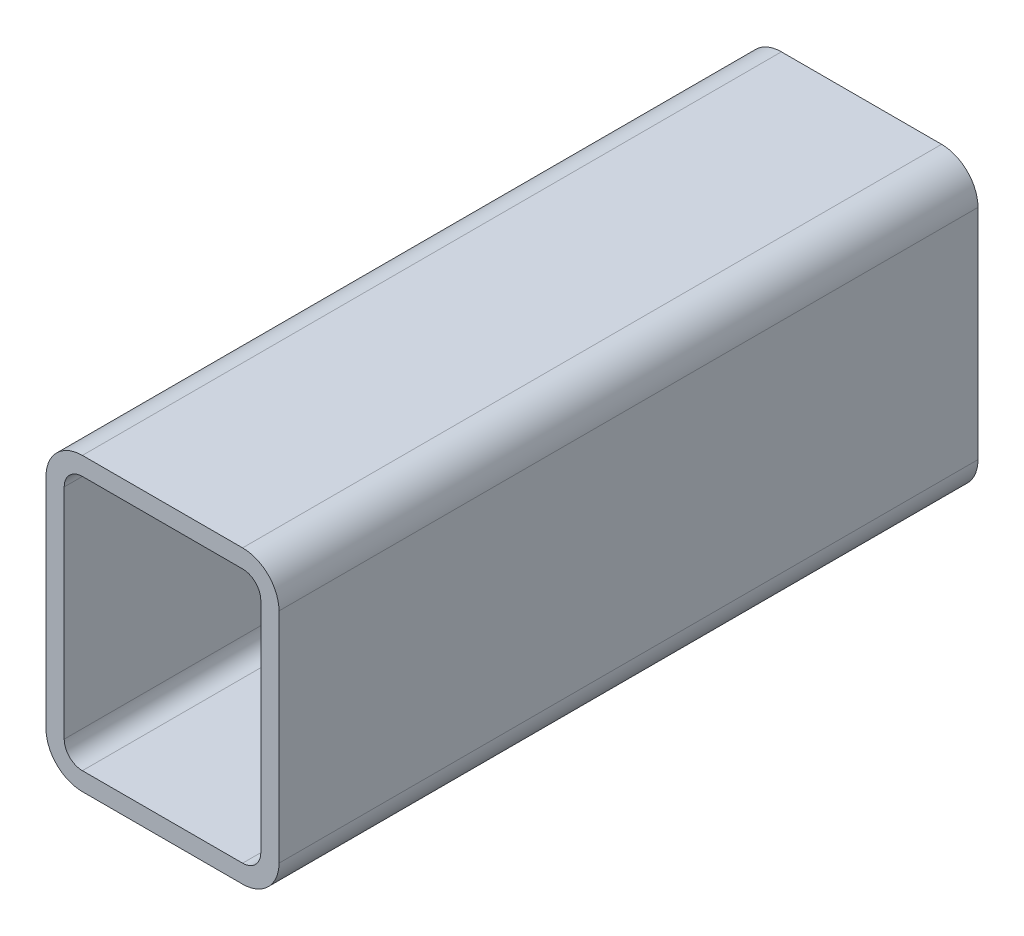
ISO-10303-21;
HEADER;
FILE_DESCRIPTION(('STEP AP214'),'2;1');
FILE_NAME('part.step','',(''),(''),'','','');
FILE_SCHEMA(('AUTOMOTIVE_DESIGN { 1 0 10303 214 1 1 1 1 }'));
ENDSEC;
DATA;
#1=APPLICATION_CONTEXT('core data for automotive mechanical design processes');
#2=APPLICATION_PROTOCOL_DEFINITION('international standard','automotive_design',2000,#1);
#3=PRODUCT_CONTEXT('',#1,'mechanical');
#4=PRODUCT('Part','Part','',(#3));
#5=PRODUCT_RELATED_PRODUCT_CATEGORY('part','',(#4));
#6=PRODUCT_DEFINITION_FORMATION('','',#4);
#7=PRODUCT_DEFINITION_CONTEXT('part definition',#1,'design');
#8=PRODUCT_DEFINITION('design','',#6,#7);
#9=PRODUCT_DEFINITION_SHAPE('','',#8);
#10=(LENGTH_UNIT() NAMED_UNIT(*) SI_UNIT(.MILLI.,.METRE.));
#11=(NAMED_UNIT(*) PLANE_ANGLE_UNIT() SI_UNIT($,.RADIAN.));
#12=(NAMED_UNIT(*) SI_UNIT($,.STERADIAN.) SOLID_ANGLE_UNIT());
#13=UNCERTAINTY_MEASURE_WITH_UNIT(LENGTH_MEASURE(1.E-05),#10,'distance_accuracy_value','');
#14=(GEOMETRIC_REPRESENTATION_CONTEXT(3) GLOBAL_UNCERTAINTY_ASSIGNED_CONTEXT((#13)) GLOBAL_UNIT_ASSIGNED_CONTEXT((#10,
#11,#12)) REPRESENTATION_CONTEXT('',''));
#15=CARTESIAN_POINT('',(0.,0.,0.));
#16=DIRECTION('',(0.,0.,1.));
#17=DIRECTION('',(1.,0.,0.));
#18=AXIS2_PLACEMENT_3D('',#15,#16,#17);
#19=CARTESIAN_POINT('',(17.5501778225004,113.15985662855,304.8));
#20=DIRECTION('',(0.,0.,1.));
#21=DIRECTION('',(1.,0.,0.));
#22=AXIS2_PLACEMENT_3D('',#19,#20,#21);
#23=PLANE('',#22);
#24=CARTESIAN_POINT('',(17.5501778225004,113.15985662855,304.8));
#25=DIRECTION('',(0.,0.,1.));
#26=DIRECTION('',(1.,0.,0.));
#27=AXIS2_PLACEMENT_3D('',#24,#25,#26);
#28=CIRCLE('',#27,15.875);
#29=CARTESIAN_POINT('',(17.5501778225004,129.03485662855,304.8));
#30=VERTEX_POINT('',#29);
#31=CARTESIAN_POINT('',(1.67517782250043,113.15985662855,304.8));
#32=VERTEX_POINT('',#31);
#33=EDGE_CURVE('E211',#30,#32,#28,.T.);
#34=ORIENTED_EDGE('',*,*,#33,.T.);
#35=DIRECTION('',(0.,-1.,0.));
#36=VECTOR('',#35,1.);
#37=CARTESIAN_POINT('',(1.67517782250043,17.90985662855,304.8));
#38=LINE('',#37,#36);
#39=CARTESIAN_POINT('',(1.67517782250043,17.90985662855,304.8));
#40=VERTEX_POINT('',#39);
#41=EDGE_CURVE('E214',#32,#40,#38,.T.);
#42=ORIENTED_EDGE('',*,*,#41,.T.);
#43=CARTESIAN_POINT('',(17.5501778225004,17.90985662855,304.8));
#44=DIRECTION('',(0.,0.,1.));
#45=DIRECTION('',(1.,0.,0.));
#46=AXIS2_PLACEMENT_3D('',#43,#44,#45);
#47=CIRCLE('',#46,15.875);
#48=CARTESIAN_POINT('',(17.5501778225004,2.03485662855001,304.8));
#49=VERTEX_POINT('',#48);
#50=EDGE_CURVE('E217',#40,#49,#47,.T.);
#51=ORIENTED_EDGE('',*,*,#50,.T.);
#52=DIRECTION('',(1.,0.,0.));
#53=VECTOR('',#52,1.);
#54=CARTESIAN_POINT('',(87.4001778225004,2.03485662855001,304.8));
#55=LINE('',#54,#53);
#56=CARTESIAN_POINT('',(87.4001778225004,2.03485662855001,304.8));
#57=VERTEX_POINT('',#56);
#58=EDGE_CURVE('E219',#49,#57,#55,.T.);
#59=ORIENTED_EDGE('',*,*,#58,.T.);
#60=CARTESIAN_POINT('',(87.4001778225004,17.90985662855,304.8));
#61=DIRECTION('',(0.,0.,1.));
#62=DIRECTION('',(1.,0.,0.));
#63=AXIS2_PLACEMENT_3D('',#60,#61,#62);
#64=CIRCLE('',#63,15.875);
#65=CARTESIAN_POINT('',(103.2751778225,17.90985662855,304.8));
#66=VERTEX_POINT('',#65);
#67=EDGE_CURVE('E221',#57,#66,#64,.T.);
#68=ORIENTED_EDGE('',*,*,#67,.T.);
#69=DIRECTION('',(0.,1.,0.));
#70=VECTOR('',#69,1.);
#71=CARTESIAN_POINT('',(103.2751778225,113.15985662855,304.8));
#72=LINE('',#71,#70);
#73=CARTESIAN_POINT('',(103.2751778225,113.15985662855,304.8));
#74=VERTEX_POINT('',#73);
#75=EDGE_CURVE('E223',#66,#74,#72,.T.);
#76=ORIENTED_EDGE('',*,*,#75,.T.);
#77=CARTESIAN_POINT('',(87.4001778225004,113.15985662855,304.8));
#78=DIRECTION('',(0.,0.,1.));
#79=DIRECTION('',(1.,0.,0.));
#80=AXIS2_PLACEMENT_3D('',#77,#78,#79);
#81=CIRCLE('',#80,15.875);
#82=CARTESIAN_POINT('',(87.4001778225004,129.03485662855,304.8));
#83=VERTEX_POINT('',#82);
#84=EDGE_CURVE('E225',#74,#83,#81,.T.);
#85=ORIENTED_EDGE('',*,*,#84,.T.);
#86=DIRECTION('',(-1.,0.,0.));
#87=VECTOR('',#86,1.);
#88=CARTESIAN_POINT('',(17.5501778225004,129.03485662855,304.8));
#89=LINE('',#88,#87);
#90=EDGE_CURVE('E227',#83,#30,#89,.T.);
#91=ORIENTED_EDGE('',*,*,#90,.T.);
#92=EDGE_LOOP('',(#34,#42,#51,#59,#68,#76,#85,#91));
#93=FACE_BOUND('',#92,.T.);
#94=DIRECTION('',(0.,-1.,0.));
#95=VECTOR('',#94,1.);
#96=CARTESIAN_POINT('',(9.61267782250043,17.90985662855,304.8));
#97=LINE('',#96,#95);
#98=CARTESIAN_POINT('',(9.61267782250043,113.15985662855,304.8));
#99=VERTEX_POINT('',#98);
#100=CARTESIAN_POINT('',(9.61267782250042,17.90985662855,304.8));
#101=VERTEX_POINT('',#100);
#102=EDGE_CURVE('E154',#99,#101,#97,.T.);
#103=ORIENTED_EDGE('',*,*,#102,.F.);
#104=CARTESIAN_POINT('',(17.5501778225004,113.15985662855,304.8));
#105=DIRECTION('',(0.,0.,1.));
#106=DIRECTION('',(1.,0.,0.));
#107=AXIS2_PLACEMENT_3D('',#104,#105,#106);
#108=CIRCLE('',#107,7.9375);
#109=CARTESIAN_POINT('',(17.5501778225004,121.09735662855,304.8));
#110=VERTEX_POINT('',#109);
#111=EDGE_CURVE('E146',#110,#99,#108,.T.);
#112=ORIENTED_EDGE('',*,*,#111,.F.);
#113=DIRECTION('',(-1.,0.,0.));
#114=VECTOR('',#113,1.);
#115=CARTESIAN_POINT('',(17.5501778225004,121.09735662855,304.8));
#116=LINE('',#115,#114);
#117=CARTESIAN_POINT('',(87.4001778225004,121.09735662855,304.8));
#118=VERTEX_POINT('',#117);
#119=EDGE_CURVE('E179',#118,#110,#116,.T.);
#120=ORIENTED_EDGE('',*,*,#119,.F.);
#121=CARTESIAN_POINT('',(87.4001778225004,113.15985662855,304.8));
#122=DIRECTION('',(0.,0.,1.));
#123=DIRECTION('',(1.,0.,0.));
#124=AXIS2_PLACEMENT_3D('',#121,#122,#123);
#125=CIRCLE('',#124,7.9375);
#126=CARTESIAN_POINT('',(95.3376778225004,113.15985662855,304.8));
#127=VERTEX_POINT('',#126);
#128=EDGE_CURVE('E177',#127,#118,#125,.T.);
#129=ORIENTED_EDGE('',*,*,#128,.F.);
#130=DIRECTION('',(0.,1.,0.));
#131=VECTOR('',#130,1.);
#132=CARTESIAN_POINT('',(95.3376778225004,113.15985662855,304.8));
#133=LINE('',#132,#131);
#134=CARTESIAN_POINT('',(95.3376778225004,17.90985662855,304.8));
#135=VERTEX_POINT('',#134);
#136=EDGE_CURVE('E175',#135,#127,#133,.T.);
#137=ORIENTED_EDGE('',*,*,#136,.F.);
#138=CARTESIAN_POINT('',(87.4001778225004,17.90985662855,304.8));
#139=DIRECTION('',(0.,0.,1.));
#140=DIRECTION('',(1.,0.,0.));
#141=AXIS2_PLACEMENT_3D('',#138,#139,#140);
#142=CIRCLE('',#141,7.9375);
#143=CARTESIAN_POINT('',(87.4001778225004,9.97235662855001,304.8));
#144=VERTEX_POINT('',#143);
#145=EDGE_CURVE('E173',#144,#135,#142,.T.);
#146=ORIENTED_EDGE('',*,*,#145,.F.);
#147=DIRECTION('',(1.,0.,0.));
#148=VECTOR('',#147,1.);
#149=CARTESIAN_POINT('',(87.4001778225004,9.97235662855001,304.8));
#150=LINE('',#149,#148);
#151=CARTESIAN_POINT('',(17.5501778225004,9.97235662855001,304.8));
#152=VERTEX_POINT('',#151);
#153=EDGE_CURVE('E169',#152,#144,#150,.T.);
#154=ORIENTED_EDGE('',*,*,#153,.F.);
#155=CARTESIAN_POINT('',(17.5501778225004,17.90985662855,304.8));
#156=DIRECTION('',(0.,0.,1.));
#157=DIRECTION('',(1.,0.,0.));
#158=AXIS2_PLACEMENT_3D('',#155,#156,#157);
#159=CIRCLE('',#158,7.9375);
#160=EDGE_CURVE('E167',#101,#152,#159,.T.);
#161=ORIENTED_EDGE('',*,*,#160,.F.);
#162=EDGE_LOOP('',(#103,#112,#120,#129,#137,#146,#154,#161));
#163=FACE_BOUND('',#162,.T.);
#164=ADVANCED_FACE('F33',(#93,#163),#23,.T.);
#165=CARTESIAN_POINT('',(17.5501778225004,113.15985662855,0.));
#166=DIRECTION('',(0.,0.,1.));
#167=DIRECTION('',(1.,0.,0.));
#168=AXIS2_PLACEMENT_3D('',#165,#166,#167);
#169=PLANE('',#168);
#170=CARTESIAN_POINT('',(17.5501778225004,113.15985662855,0.));
#171=DIRECTION('',(0.,0.,1.));
#172=DIRECTION('',(1.,0.,0.));
#173=AXIS2_PLACEMENT_3D('',#170,#171,#172);
#174=CIRCLE('',#173,15.875);
#175=CARTESIAN_POINT('',(17.5501778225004,129.03485662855,0.));
#176=VERTEX_POINT('',#175);
#177=CARTESIAN_POINT('',(1.67517782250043,113.15985662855,0.));
#178=VERTEX_POINT('',#177);
#179=EDGE_CURVE('E162',#176,#178,#174,.T.);
#180=ORIENTED_EDGE('',*,*,#179,.F.);
#181=DIRECTION('',(-1.,0.,0.));
#182=VECTOR('',#181,1.);
#183=CARTESIAN_POINT('',(17.5501778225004,129.03485662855,0.));
#184=LINE('',#183,#182);
#185=CARTESIAN_POINT('',(87.4001778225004,129.03485662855,0.));
#186=VERTEX_POINT('',#185);
#187=EDGE_CURVE('E215',#186,#176,#184,.T.);
#188=ORIENTED_EDGE('',*,*,#187,.F.);
#189=CARTESIAN_POINT('',(87.4001778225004,113.15985662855,0.));
#190=DIRECTION('',(0.,0.,1.));
#191=DIRECTION('',(1.,0.,0.));
#192=AXIS2_PLACEMENT_3D('',#189,#190,#191);
#193=CIRCLE('',#192,15.875);
#194=CARTESIAN_POINT('',(103.2751778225,113.15985662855,0.));
#195=VERTEX_POINT('',#194);
#196=EDGE_CURVE('E242',#195,#186,#193,.T.);
#197=ORIENTED_EDGE('',*,*,#196,.F.);
#198=DIRECTION('',(0.,1.,0.));
#199=VECTOR('',#198,1.);
#200=CARTESIAN_POINT('',(103.2751778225,113.15985662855,0.));
#201=LINE('',#200,#199);
#202=CARTESIAN_POINT('',(103.2751778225,17.90985662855,0.));
#203=VERTEX_POINT('',#202);
#204=EDGE_CURVE('E240',#203,#195,#201,.T.);
#205=ORIENTED_EDGE('',*,*,#204,.F.);
#206=CARTESIAN_POINT('',(87.4001778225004,17.90985662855,0.));
#207=DIRECTION('',(0.,0.,1.));
#208=DIRECTION('',(1.,0.,0.));
#209=AXIS2_PLACEMENT_3D('',#206,#207,#208);
#210=CIRCLE('',#209,15.875);
#211=CARTESIAN_POINT('',(87.4001778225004,2.03485662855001,0.));
#212=VERTEX_POINT('',#211);
#213=EDGE_CURVE('E238',#212,#203,#210,.T.);
#214=ORIENTED_EDGE('',*,*,#213,.F.);
#215=DIRECTION('',(1.,0.,0.));
#216=VECTOR('',#215,1.);
#217=CARTESIAN_POINT('',(87.4001778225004,2.03485662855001,0.));
#218=LINE('',#217,#216);
#219=CARTESIAN_POINT('',(17.5501778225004,2.03485662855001,0.));
#220=VERTEX_POINT('',#219);
#221=EDGE_CURVE('E236',#220,#212,#218,.T.);
#222=ORIENTED_EDGE('',*,*,#221,.F.);
#223=CARTESIAN_POINT('',(17.5501778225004,17.90985662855,0.));
#224=DIRECTION('',(0.,0.,1.));
#225=DIRECTION('',(1.,0.,0.));
#226=AXIS2_PLACEMENT_3D('',#223,#224,#225);
#227=CIRCLE('',#226,15.875);
#228=CARTESIAN_POINT('',(1.67517782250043,17.90985662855,0.));
#229=VERTEX_POINT('',#228);
#230=EDGE_CURVE('E234',#229,#220,#227,.T.);
#231=ORIENTED_EDGE('',*,*,#230,.F.);
#232=DIRECTION('',(0.,-1.,0.));
#233=VECTOR('',#232,1.);
#234=CARTESIAN_POINT('',(1.67517782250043,17.90985662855,0.));
#235=LINE('',#234,#233);
#236=EDGE_CURVE('E232',#178,#229,#235,.T.);
#237=ORIENTED_EDGE('',*,*,#236,.F.);
#238=EDGE_LOOP('',(#180,#188,#197,#205,#214,#222,#231,#237));
#239=FACE_BOUND('',#238,.T.);
#240=CARTESIAN_POINT('',(17.5501778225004,113.15985662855,0.));
#241=DIRECTION('',(0.,0.,1.));
#242=DIRECTION('',(1.,0.,0.));
#243=AXIS2_PLACEMENT_3D('',#240,#241,#242);
#244=CIRCLE('',#243,7.9375);
#245=CARTESIAN_POINT('',(17.5501778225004,121.09735662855,0.));
#246=VERTEX_POINT('',#245);
#247=CARTESIAN_POINT('',(9.61267782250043,113.15985662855,0.));
#248=VERTEX_POINT('',#247);
#249=EDGE_CURVE('E56',#246,#248,#244,.T.);
#250=ORIENTED_EDGE('',*,*,#249,.T.);
#251=DIRECTION('',(0.,-1.,0.));
#252=VECTOR('',#251,1.);
#253=CARTESIAN_POINT('',(9.61267782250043,17.90985662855,0.));
#254=LINE('',#253,#252);
#255=CARTESIAN_POINT('',(9.61267782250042,17.90985662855,0.));
#256=VERTEX_POINT('',#255);
#257=EDGE_CURVE('E161',#248,#256,#254,.T.);
#258=ORIENTED_EDGE('',*,*,#257,.T.);
#259=CARTESIAN_POINT('',(17.5501778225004,17.90985662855,0.));
#260=DIRECTION('',(0.,0.,1.));
#261=DIRECTION('',(1.,0.,0.));
#262=AXIS2_PLACEMENT_3D('',#259,#260,#261);
#263=CIRCLE('',#262,7.9375);
#264=CARTESIAN_POINT('',(17.5501778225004,9.97235662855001,0.));
#265=VERTEX_POINT('',#264);
#266=EDGE_CURVE('E183',#256,#265,#263,.T.);
#267=ORIENTED_EDGE('',*,*,#266,.T.);
#268=DIRECTION('',(1.,0.,0.));
#269=VECTOR('',#268,1.);
#270=CARTESIAN_POINT('',(87.4001778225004,9.97235662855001,0.));
#271=LINE('',#270,#269);
#272=CARTESIAN_POINT('',(87.4001778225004,9.97235662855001,0.));
#273=VERTEX_POINT('',#272);
#274=EDGE_CURVE('E186',#265,#273,#271,.T.);
#275=ORIENTED_EDGE('',*,*,#274,.T.);
#276=CARTESIAN_POINT('',(87.4001778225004,17.90985662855,0.));
#277=DIRECTION('',(0.,0.,1.));
#278=DIRECTION('',(1.,0.,0.));
#279=AXIS2_PLACEMENT_3D('',#276,#277,#278);
#280=CIRCLE('',#279,7.9375);
#281=CARTESIAN_POINT('',(95.3376778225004,17.90985662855,0.));
#282=VERTEX_POINT('',#281);
#283=EDGE_CURVE('E189',#273,#282,#280,.T.);
#284=ORIENTED_EDGE('',*,*,#283,.T.);
#285=DIRECTION('',(0.,1.,0.));
#286=VECTOR('',#285,1.);
#287=CARTESIAN_POINT('',(95.3376778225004,113.15985662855,0.));
#288=LINE('',#287,#286);
#289=CARTESIAN_POINT('',(95.3376778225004,113.15985662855,0.));
#290=VERTEX_POINT('',#289);
#291=EDGE_CURVE('E192',#282,#290,#288,.T.);
#292=ORIENTED_EDGE('',*,*,#291,.T.);
#293=CARTESIAN_POINT('',(87.4001778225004,113.15985662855,0.));
#294=DIRECTION('',(0.,0.,1.));
#295=DIRECTION('',(1.,0.,0.));
#296=AXIS2_PLACEMENT_3D('',#293,#294,#295);
#297=CIRCLE('',#296,7.9375);
#298=CARTESIAN_POINT('',(87.4001778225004,121.09735662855,0.));
#299=VERTEX_POINT('',#298);
#300=EDGE_CURVE('E195',#290,#299,#297,.T.);
#301=ORIENTED_EDGE('',*,*,#300,.T.);
#302=DIRECTION('',(-1.,0.,0.));
#303=VECTOR('',#302,1.);
#304=CARTESIAN_POINT('',(17.5501778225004,121.09735662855,0.));
#305=LINE('',#304,#303);
#306=EDGE_CURVE('E155',#299,#246,#305,.T.);
#307=ORIENTED_EDGE('',*,*,#306,.T.);
#308=EDGE_LOOP('',(#250,#258,#267,#275,#284,#292,#301,#307));
#309=FACE_BOUND('',#308,.T.);
#310=ADVANCED_FACE('F272',(#239,#309),#169,.F.);
#311=CARTESIAN_POINT('',(17.5501778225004,113.15985662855,304.8));
#312=DIRECTION('',(0.,0.,-1.));
#313=DIRECTION('',(-1.,0.,0.));
#314=AXIS2_PLACEMENT_3D('',#311,#312,#313);
#315=CYLINDRICAL_SURFACE('',#314,15.875);
#316=ORIENTED_EDGE('',*,*,#179,.T.);
#317=DIRECTION('',(0.,0.,-1.));
#318=VECTOR('',#317,1.);
#319=CARTESIAN_POINT('',(1.67517782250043,113.15985662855,304.8));
#320=LINE('',#319,#318);
#321=EDGE_CURVE('E11',#32,#178,#320,.T.);
#322=ORIENTED_EDGE('',*,*,#321,.F.);
#323=ORIENTED_EDGE('',*,*,#33,.F.);
#324=DIRECTION('',(0.,0.,-1.));
#325=VECTOR('',#324,1.);
#326=CARTESIAN_POINT('',(17.5501778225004,129.03485662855,304.8));
#327=LINE('',#326,#325);
#328=EDGE_CURVE('E229',#30,#176,#327,.T.);
#329=ORIENTED_EDGE('',*,*,#328,.T.);
#330=EDGE_LOOP('',(#316,#322,#323,#329));
#331=FACE_BOUND('',#330,.T.);
#332=ADVANCED_FACE('F35',(#331),#315,.T.);
#333=CARTESIAN_POINT('',(1.67517782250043,17.90985662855,304.8));
#334=DIRECTION('',(1.,0.,0.));
#335=DIRECTION('',(0.,0.,-1.));
#336=AXIS2_PLACEMENT_3D('',#333,#334,#335);
#337=PLANE('',#336);
#338=ORIENTED_EDGE('',*,*,#236,.T.);
#339=DIRECTION('',(0.,0.,-1.));
#340=VECTOR('',#339,1.);
#341=CARTESIAN_POINT('',(1.67517782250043,17.90985662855,304.8));
#342=LINE('',#341,#340);
#343=EDGE_CURVE('E41',#40,#229,#342,.T.);
#344=ORIENTED_EDGE('',*,*,#343,.F.);
#345=ORIENTED_EDGE('',*,*,#41,.F.);
#346=ORIENTED_EDGE('',*,*,#321,.T.);
#347=EDGE_LOOP('',(#338,#344,#345,#346));
#348=FACE_BOUND('',#347,.T.);
#349=ADVANCED_FACE('F289',(#348),#337,.F.);
#350=CARTESIAN_POINT('',(17.5501778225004,17.90985662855,304.8));
#351=DIRECTION('',(0.,0.,-1.));
#352=DIRECTION('',(-1.,0.,0.));
#353=AXIS2_PLACEMENT_3D('',#350,#351,#352);
#354=CYLINDRICAL_SURFACE('',#353,15.875);
#355=ORIENTED_EDGE('',*,*,#230,.T.);
#356=DIRECTION('',(0.,0.,-1.));
#357=VECTOR('',#356,1.);
#358=CARTESIAN_POINT('',(17.5501778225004,2.03485662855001,304.8));
#359=LINE('',#358,#357);
#360=EDGE_CURVE('E259',#49,#220,#359,.T.);
#361=ORIENTED_EDGE('',*,*,#360,.F.);
#362=ORIENTED_EDGE('',*,*,#50,.F.);
#363=ORIENTED_EDGE('',*,*,#343,.T.);
#364=EDGE_LOOP('',(#355,#361,#362,#363));
#365=FACE_BOUND('',#364,.T.);
#366=ADVANCED_FACE('F266',(#365),#354,.T.);
#367=CARTESIAN_POINT('',(87.4001778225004,2.03485662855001,304.8));
#368=DIRECTION('',(0.,1.,0.));
#369=DIRECTION('',(0.,0.,1.));
#370=AXIS2_PLACEMENT_3D('',#367,#368,#369);
#371=PLANE('',#370);
#372=ORIENTED_EDGE('',*,*,#221,.T.);
#373=DIRECTION('',(0.,0.,-1.));
#374=VECTOR('',#373,1.);
#375=CARTESIAN_POINT('',(87.4001778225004,2.03485662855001,304.8));
#376=LINE('',#375,#374);
#377=EDGE_CURVE('E256',#57,#212,#376,.T.);
#378=ORIENTED_EDGE('',*,*,#377,.F.);
#379=ORIENTED_EDGE('',*,*,#58,.F.);
#380=ORIENTED_EDGE('',*,*,#360,.T.);
#381=EDGE_LOOP('',(#372,#378,#379,#380));
#382=FACE_BOUND('',#381,.T.);
#383=ADVANCED_FACE('F278',(#382),#371,.F.);
#384=CARTESIAN_POINT('',(87.4001778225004,17.90985662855,304.8));
#385=DIRECTION('',(0.,0.,-1.));
#386=DIRECTION('',(-1.,0.,0.));
#387=AXIS2_PLACEMENT_3D('',#384,#385,#386);
#388=CYLINDRICAL_SURFACE('',#387,15.875);
#389=ORIENTED_EDGE('',*,*,#213,.T.);
#390=DIRECTION('',(0.,0.,-1.));
#391=VECTOR('',#390,1.);
#392=CARTESIAN_POINT('',(103.2751778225,17.90985662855,304.8));
#393=LINE('',#392,#391);
#394=EDGE_CURVE('E253',#66,#203,#393,.T.);
#395=ORIENTED_EDGE('',*,*,#394,.F.);
#396=ORIENTED_EDGE('',*,*,#67,.F.);
#397=ORIENTED_EDGE('',*,*,#377,.T.);
#398=EDGE_LOOP('',(#389,#395,#396,#397));
#399=FACE_BOUND('',#398,.T.);
#400=ADVANCED_FACE('F282',(#399),#388,.T.);
#401=CARTESIAN_POINT('',(103.2751778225,113.15985662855,304.8));
#402=DIRECTION('',(-1.,0.,0.));
#403=DIRECTION('',(0.,0.,1.));
#404=AXIS2_PLACEMENT_3D('',#401,#402,#403);
#405=PLANE('',#404);
#406=ORIENTED_EDGE('',*,*,#204,.T.);
#407=DIRECTION('',(0.,0.,-1.));
#408=VECTOR('',#407,1.);
#409=CARTESIAN_POINT('',(103.2751778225,113.15985662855,304.8));
#410=LINE('',#409,#408);
#411=EDGE_CURVE('E250',#74,#195,#410,.T.);
#412=ORIENTED_EDGE('',*,*,#411,.F.);
#413=ORIENTED_EDGE('',*,*,#75,.F.);
#414=ORIENTED_EDGE('',*,*,#394,.T.);
#415=EDGE_LOOP('',(#406,#412,#413,#414));
#416=FACE_BOUND('',#415,.T.);
#417=ADVANCED_FACE('F302',(#416),#405,.F.);
#418=CARTESIAN_POINT('',(87.4001778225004,113.15985662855,304.8));
#419=DIRECTION('',(0.,0.,-1.));
#420=DIRECTION('',(-1.,0.,0.));
#421=AXIS2_PLACEMENT_3D('',#418,#419,#420);
#422=CYLINDRICAL_SURFACE('',#421,15.875);
#423=ORIENTED_EDGE('',*,*,#196,.T.);
#424=DIRECTION('',(0.,0.,-1.));
#425=VECTOR('',#424,1.);
#426=CARTESIAN_POINT('',(87.4001778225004,129.03485662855,304.8));
#427=LINE('',#426,#425);
#428=EDGE_CURVE('E247',#83,#186,#427,.T.);
#429=ORIENTED_EDGE('',*,*,#428,.F.);
#430=ORIENTED_EDGE('',*,*,#84,.F.);
#431=ORIENTED_EDGE('',*,*,#411,.T.);
#432=EDGE_LOOP('',(#423,#429,#430,#431));
#433=FACE_BOUND('',#432,.T.);
#434=ADVANCED_FACE('F300',(#433),#422,.T.);
#435=CARTESIAN_POINT('',(17.5501778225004,129.03485662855,304.8));
#436=DIRECTION('',(0.,-1.,0.));
#437=DIRECTION('',(0.,0.,-1.));
#438=AXIS2_PLACEMENT_3D('',#435,#436,#437);
#439=PLANE('',#438);
#440=ORIENTED_EDGE('',*,*,#187,.T.);
#441=ORIENTED_EDGE('',*,*,#328,.F.);
#442=ORIENTED_EDGE('',*,*,#90,.F.);
#443=ORIENTED_EDGE('',*,*,#428,.T.);
#444=EDGE_LOOP('',(#440,#441,#442,#443));
#445=FACE_BOUND('',#444,.T.);
#446=ADVANCED_FACE('F295',(#445),#439,.F.);
#447=CARTESIAN_POINT('',(17.5501778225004,113.15985662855,304.8));
#448=DIRECTION('',(0.,0.,-1.));
#449=DIRECTION('',(-1.,0.,0.));
#450=AXIS2_PLACEMENT_3D('',#447,#448,#449);
#451=CYLINDRICAL_SURFACE('',#450,7.9375);
#452=ORIENTED_EDGE('',*,*,#249,.F.);
#453=DIRECTION('',(0.,0.,-1.));
#454=VECTOR('',#453,1.);
#455=CARTESIAN_POINT('',(17.5501778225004,121.09735662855,304.8));
#456=LINE('',#455,#454);
#457=EDGE_CURVE('E150',#110,#246,#456,.T.);
#458=ORIENTED_EDGE('',*,*,#457,.F.);
#459=ORIENTED_EDGE('',*,*,#111,.T.);
#460=DIRECTION('',(0.,0.,-1.));
#461=VECTOR('',#460,1.);
#462=CARTESIAN_POINT('',(9.61267782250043,113.15985662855,304.8));
#463=LINE('',#462,#461);
#464=EDGE_CURVE('E149',#99,#248,#463,.T.);
#465=ORIENTED_EDGE('',*,*,#464,.T.);
#466=EDGE_LOOP('',(#452,#458,#459,#465));
#467=FACE_BOUND('',#466,.T.);
#468=ADVANCED_FACE('F148',(#467),#451,.F.);
#469=CARTESIAN_POINT('',(9.61267782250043,17.90985662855,304.8));
#470=DIRECTION('',(1.,0.,0.));
#471=DIRECTION('',(0.,0.,-1.));
#472=AXIS2_PLACEMENT_3D('',#469,#470,#471);
#473=PLANE('',#472);
#474=ORIENTED_EDGE('',*,*,#257,.F.);
#475=ORIENTED_EDGE('',*,*,#464,.F.);
#476=ORIENTED_EDGE('',*,*,#102,.T.);
#477=DIRECTION('',(0.,0.,-1.));
#478=VECTOR('',#477,1.);
#479=CARTESIAN_POINT('',(9.61267782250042,17.90985662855,304.8));
#480=LINE('',#479,#478);
#481=EDGE_CURVE('E163',#101,#256,#480,.T.);
#482=ORIENTED_EDGE('',*,*,#481,.T.);
#483=EDGE_LOOP('',(#474,#475,#476,#482));
#484=FACE_BOUND('',#483,.T.);
#485=ADVANCED_FACE('F158',(#484),#473,.T.);
#486=CARTESIAN_POINT('',(17.5501778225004,17.90985662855,304.8));
#487=DIRECTION('',(0.,0.,-1.));
#488=DIRECTION('',(-1.,0.,0.));
#489=AXIS2_PLACEMENT_3D('',#486,#487,#488);
#490=CYLINDRICAL_SURFACE('',#489,7.9375);
#491=ORIENTED_EDGE('',*,*,#266,.F.);
#492=ORIENTED_EDGE('',*,*,#481,.F.);
#493=ORIENTED_EDGE('',*,*,#160,.T.);
#494=DIRECTION('',(0.,0.,-1.));
#495=VECTOR('',#494,1.);
#496=CARTESIAN_POINT('',(17.5501778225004,9.97235662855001,304.8));
#497=LINE('',#496,#495);
#498=EDGE_CURVE('E208',#152,#265,#497,.T.);
#499=ORIENTED_EDGE('',*,*,#498,.T.);
#500=EDGE_LOOP('',(#491,#492,#493,#499));
#501=FACE_BOUND('',#500,.T.);
#502=ADVANCED_FACE('F327',(#501),#490,.F.);
#503=CARTESIAN_POINT('',(87.4001778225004,9.97235662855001,304.8));
#504=DIRECTION('',(0.,1.,0.));
#505=DIRECTION('',(0.,0.,1.));
#506=AXIS2_PLACEMENT_3D('',#503,#504,#505);
#507=PLANE('',#506);
#508=ORIENTED_EDGE('',*,*,#274,.F.);
#509=ORIENTED_EDGE('',*,*,#498,.F.);
#510=ORIENTED_EDGE('',*,*,#153,.T.);
#511=DIRECTION('',(0.,0.,-1.));
#512=VECTOR('',#511,1.);
#513=CARTESIAN_POINT('',(87.4001778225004,9.97235662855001,304.8));
#514=LINE('',#513,#512);
#515=EDGE_CURVE('E206',#144,#273,#514,.T.);
#516=ORIENTED_EDGE('',*,*,#515,.T.);
#517=EDGE_LOOP('',(#508,#509,#510,#516));
#518=FACE_BOUND('',#517,.T.);
#519=ADVANCED_FACE('F331',(#518),#507,.T.);
#520=CARTESIAN_POINT('',(87.4001778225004,17.90985662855,304.8));
#521=DIRECTION('',(0.,0.,-1.));
#522=DIRECTION('',(-1.,0.,0.));
#523=AXIS2_PLACEMENT_3D('',#520,#521,#522);
#524=CYLINDRICAL_SURFACE('',#523,7.9375);
#525=ORIENTED_EDGE('',*,*,#283,.F.);
#526=ORIENTED_EDGE('',*,*,#515,.F.);
#527=ORIENTED_EDGE('',*,*,#145,.T.);
#528=DIRECTION('',(0.,0.,-1.));
#529=VECTOR('',#528,1.);
#530=CARTESIAN_POINT('',(95.3376778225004,17.90985662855,304.8));
#531=LINE('',#530,#529);
#532=EDGE_CURVE('E204',#135,#282,#531,.T.);
#533=ORIENTED_EDGE('',*,*,#532,.T.);
#534=EDGE_LOOP('',(#525,#526,#527,#533));
#535=FACE_BOUND('',#534,.T.);
#536=ADVANCED_FACE('F337',(#535),#524,.F.);
#537=CARTESIAN_POINT('',(95.3376778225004,113.15985662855,304.8));
#538=DIRECTION('',(-1.,0.,0.));
#539=DIRECTION('',(0.,0.,1.));
#540=AXIS2_PLACEMENT_3D('',#537,#538,#539);
#541=PLANE('',#540);
#542=ORIENTED_EDGE('',*,*,#291,.F.);
#543=ORIENTED_EDGE('',*,*,#532,.F.);
#544=ORIENTED_EDGE('',*,*,#136,.T.);
#545=DIRECTION('',(0.,0.,-1.));
#546=VECTOR('',#545,1.);
#547=CARTESIAN_POINT('',(95.3376778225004,113.15985662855,304.8));
#548=LINE('',#547,#546);
#549=EDGE_CURVE('E202',#127,#290,#548,.T.);
#550=ORIENTED_EDGE('',*,*,#549,.T.);
#551=EDGE_LOOP('',(#542,#543,#544,#550));
#552=FACE_BOUND('',#551,.T.);
#553=ADVANCED_FACE('F341',(#552),#541,.T.);
#554=CARTESIAN_POINT('',(87.4001778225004,113.15985662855,304.8));
#555=DIRECTION('',(0.,0.,-1.));
#556=DIRECTION('',(-1.,0.,0.));
#557=AXIS2_PLACEMENT_3D('',#554,#555,#556);
#558=CYLINDRICAL_SURFACE('',#557,7.9375);
#559=ORIENTED_EDGE('',*,*,#300,.F.);
#560=ORIENTED_EDGE('',*,*,#549,.F.);
#561=ORIENTED_EDGE('',*,*,#128,.T.);
#562=DIRECTION('',(0.,0.,-1.));
#563=VECTOR('',#562,1.);
#564=CARTESIAN_POINT('',(87.4001778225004,121.09735662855,304.8));
#565=LINE('',#564,#563);
#566=EDGE_CURVE('E48',#118,#299,#565,.T.);
#567=ORIENTED_EDGE('',*,*,#566,.T.);
#568=EDGE_LOOP('',(#559,#560,#561,#567));
#569=FACE_BOUND('',#568,.T.);
#570=ADVANCED_FACE('F345',(#569),#558,.F.);
#571=CARTESIAN_POINT('',(17.5501778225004,121.09735662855,304.8));
#572=DIRECTION('',(0.,-1.,0.));
#573=DIRECTION('',(0.,0.,-1.));
#574=AXIS2_PLACEMENT_3D('',#571,#572,#573);
#575=PLANE('',#574);
#576=ORIENTED_EDGE('',*,*,#306,.F.);
#577=ORIENTED_EDGE('',*,*,#566,.F.);
#578=ORIENTED_EDGE('',*,*,#119,.T.);
#579=ORIENTED_EDGE('',*,*,#457,.T.);
#580=EDGE_LOOP('',(#576,#577,#578,#579));
#581=FACE_BOUND('',#580,.T.);
#582=ADVANCED_FACE('F349',(#581),#575,.T.);
#583=CLOSED_SHELL('',(#164,#310,#332,#349,#366,#383,#400,#417,#434,#446,#468,#485,#502,#519,
#536,#553,#570,#582));
#584=MANIFOLD_SOLID_BREP('B2',#583);
#585=ADVANCED_BREP_SHAPE_REPRESENTATION('',(#18,#584),#14);
#586=SHAPE_DEFINITION_REPRESENTATION(#9,#585);
ENDSEC;
END-ISO-10303-21;
